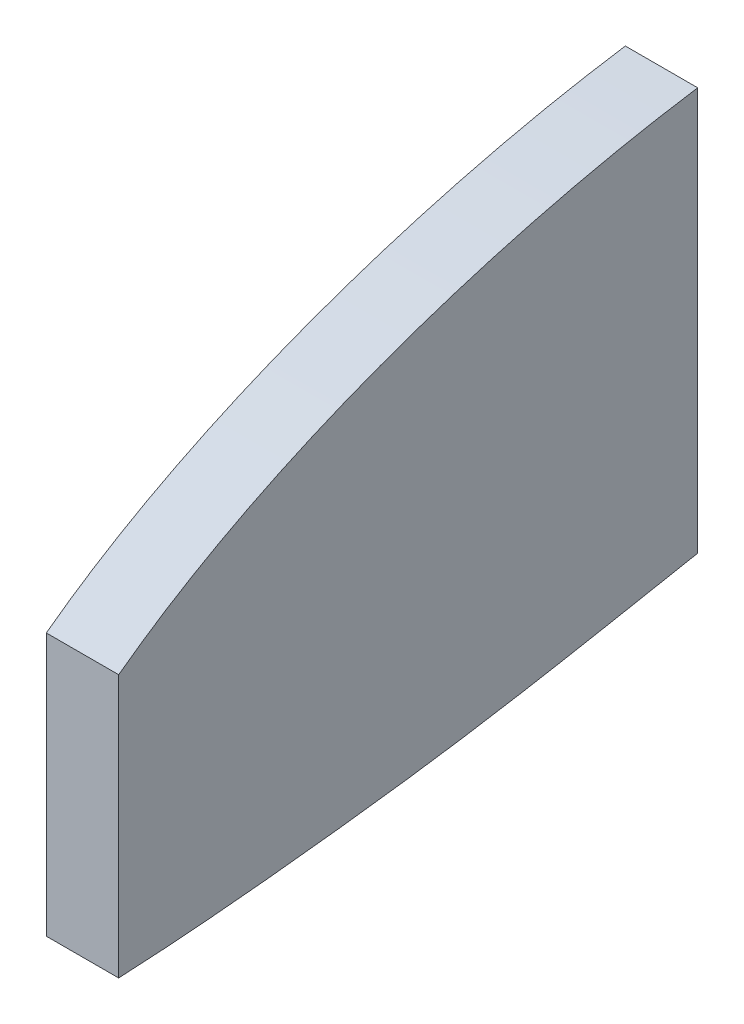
from build123d import *

# Parameters (mm, degrees)
BOSS_EXTRUDE1_DEPTH = 3.175


with BuildPart() as part:
    # Sketch1 → Boss-Extrude1 (new body)
    with BuildSketch(Plane(origin=(0, 0, 0), x_dir=(0, 0, -1), z_dir=(1, 0, 0))):
        with BuildLine():
            Line((6.35, 9.311423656), (6.35, -2.210463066))
            add(Edge.make_bspline(
                [(6.35, -2.210463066), (6.486566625, -2.203811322), (7.565548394, -2.148204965), (9.729376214, -2.005282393), (12.969817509, -1.706991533), (16.602260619, -1.303132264), (20.608996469, -0.785005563), (24.988098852, -0.060426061), (28.737312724, 0.653519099), (31.039491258, 1.092147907), (31.75, 1.227331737)],
                knots=[0.536375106, 0.536375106, 0.536375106, 0.536375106, 0.537715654, 0.546967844, 0.557637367, 0.569620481, 0.582804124, 0.597246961, 0.613135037, 0.620226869, 0.620226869, 0.620226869, 0.620226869], degree=3))
            Line((31.75, 1.227331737), (31.75, 18.908657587))
            add(Edge.make_bspline(
                [(31.75, 18.908657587), (30.828239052, 18.76805762), (28.650628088, 18.39398959), (25.29796595, 17.648544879), (21.762159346, 16.672941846), (18.446208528, 15.570753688), (15.364223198, 14.367776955), (12.535354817, 13.070455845), (9.968683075, 11.705146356), (7.933265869, 10.445275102), (6.770841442, 9.624369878), (6.35, 9.311423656)],
                knots=[1.383511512, 1.383511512, 1.383511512, 1.383511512, 1.392652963, 1.405170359, 1.417171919, 1.428603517, 1.439418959, 1.449596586, 1.459102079, 1.467907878, 1.473049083, 1.473049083, 1.473049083, 1.473049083], degree=3))
        make_face()
    extrude(amount=BOSS_EXTRUDE1_DEPTH)


solid = part.part
